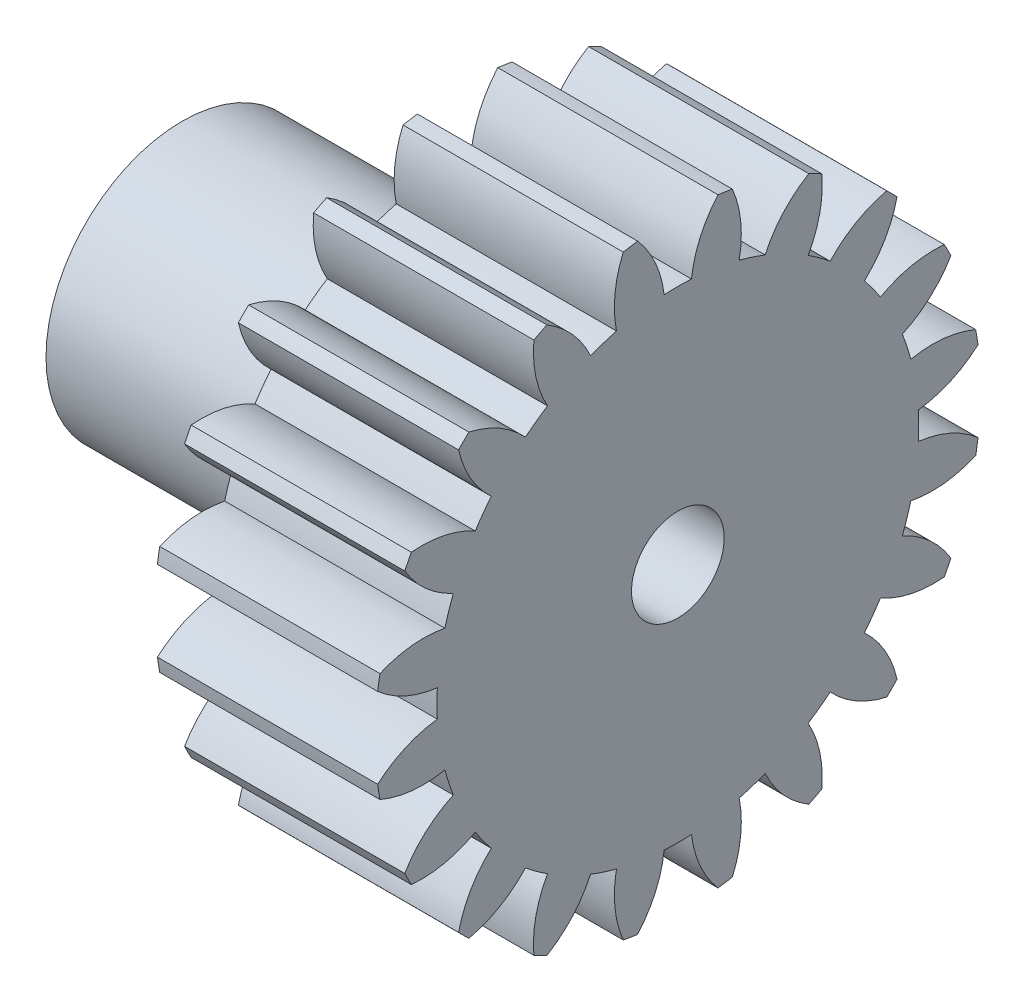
from build123d import *
from build123d.topology import SkipClean

# Parameters (mm, degrees)
BASPROSKE_W         = 20
BASPROSKE_H         = 27.5
TOOTHCUT_DEPTH      = 44.732139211
TEETHCUTS_COUNT     = 20
TEETHCUTS_ANGLE     = 342
SCALE1_SCALE        = 0.6
CUT_EXTRUDE1_DEPTH  = 29.123355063
CUT_EXTRUDE2_START  = -6
SKETCH2_R           = 2.525
CUT_EXTRUDE2_DEPTH  = 6
SKETCH3_R           = 7.425
BOSS_EXTRUDE1_DEPTH = 15
SKETCH4_R           = 5.425
CUT_EXTRUDE3_DEPTH  = 14


with BuildPart() as part:
    # BasProSke → Base-Revolve (revolve)
    with BuildSketch(Plane(origin=(0, 0, 0), x_dir=(1, 0, 0), z_dir=(0, 1, 0)), mode=Mode.PRIVATE) as base_revolve_sk:
        with Locations((10, 13.75)):
            Rectangle(BASPROSKE_W, BASPROSKE_H)
    revolve(base_revolve_sk.sketch.rotate(Axis((-10, 0, 0), (1, 0, 0)), 180), axis=Axis((-10, 0, 0), (1, 0, 0)))

    # TooCutSke → ToothCut (cut, through all)
    with BuildSketch(Plane(origin=(0, 0, 0), x_dir=(0, 0, -1), z_dir=(1, 0, 0))):
        with BuildLine():
            ThreePointArc((1.237725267, 21.838954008), (0, 21.874), (-1.237725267, 21.838954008))
            ThreePointArc((-1.237725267, 21.838954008), (-2.037783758, 24.744650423), (-3.667234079, 27.280011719))
            ThreePointArc((-3.667234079, 27.280011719), (0, 27.5254), (3.667234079, 27.280011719))
            ThreePointArc((3.667234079, 27.280011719), (2.037783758, 24.744650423), (1.237725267, 21.838954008))
        make_face()
    toothcut = extrude(amount=TOOTHCUT_DEPTH, mode=Mode.SUBTRACT)

    # TeethCuts: ToothCut ×20 about axis
    teethcuts_axis = Axis((-10, 0, 0), (1, 0, 0))
    for i in range(1, TEETHCUTS_COUNT):
        add(toothcut.rotate(teethcuts_axis, i * TEETHCUTS_ANGLE / (TEETHCUTS_COUNT - 1)), mode=Mode.SUBTRACT)


with BuildPart() as part_1:
    # Scale1: scaled about (10, 0, 0)
    add(part.part.scale(SCALE1_SCALE).moved(Location((4, 0, 0))))

    # Sketch1 → Cut-Extrude1 (cut, through all)
    with BuildSketch(Plane(origin=(0, 0, 0), x_dir=(0, 0, -1), z_dir=(1, 0, 0))):
        with BuildLine():
            Line((-2.01, 1.528242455), (2.01, 1.528242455))
            ThreePointArc((2.01, 1.528242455), (0, -2.525), (-2.01, 1.528242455))
        make_face()
    extrude(amount=CUT_EXTRUDE1_DEPTH, mode=Mode.SUBTRACT)

    # Sketch2 → Cut-Extrude2 (cut)
    with BuildSketch(Plane(origin=(16, 0, 0), x_dir=(0, 0, -1), z_dir=(1, 0, 0)).offset(CUT_EXTRUDE2_START)):
        with Locations(Location((0, 0, 0), (0, 0, 142.753559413))):
            Circle(SKETCH2_R)
    extrude(amount=CUT_EXTRUDE2_DEPTH, mode=Mode.SUBTRACT)

    # Sketch3 → Boss-Extrude1 (add)
    with SkipClean():  # the faces are left unmerged after this step: merging them gives an invalid solid
        with BuildSketch(Plane.ZY.offset(-4)):
            with Locations(Location((0, 0, 0), (0, 0, 180))):
                Circle(SKETCH3_R)
        extrude(amount=BOSS_EXTRUDE1_DEPTH)

    # Sketch4 → Cut-Extrude3 (cut)
    with SkipClean():  # the faces are left unmerged after this step: merging them gives an invalid solid
        with BuildSketch(Plane.ZY.offset(11)):
            Circle(SKETCH4_R)
        extrude(amount=-CUT_EXTRUDE3_DEPTH, mode=Mode.SUBTRACT)


solid = part_1.part
